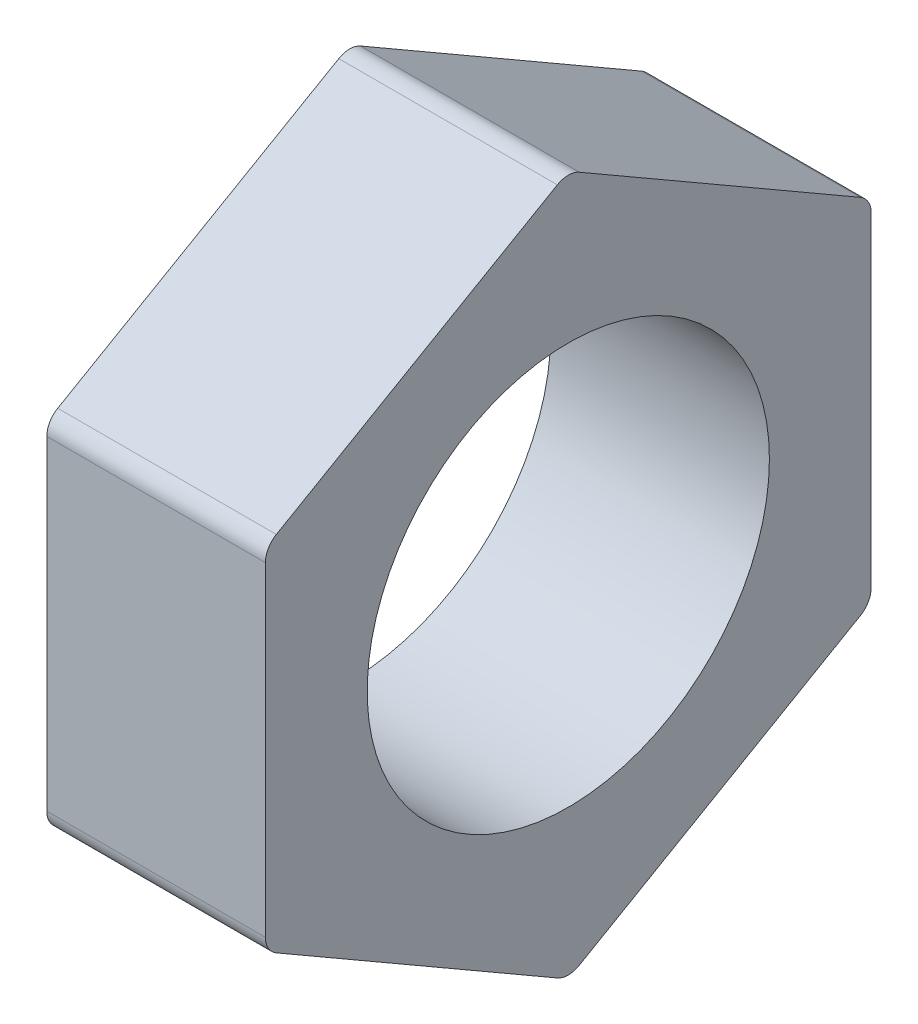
from build123d import *

# Parameters (mm, degrees)
SKETCH1_R           = 4.6
BOSS_EXTRUDE1_DEPTH = 2.5


with BuildPart() as part:
    # Sketch1 → Boss-Extrude1 (new, symmetric)
    with BuildSketch(Plane(origin=(0, 0, 0), x_dir=(0, 0, -1), z_dir=(1, 0, 0))):
        with BuildLine():
            Line((-6.67820323, 4.144337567), (-0.25, 7.855662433))
            ThreePointArc((-0.25, 7.855662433), (0, 7.922649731), (0.25, 7.855662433))
            Line((0.25, 7.855662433), (6.67820323, 4.144337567))
            ThreePointArc((6.67820323, 4.144337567), (6.861215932, 3.961324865), (6.92820323, 3.711324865))
            Line((6.92820323, 3.711324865), (6.92820323, -3.711324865))
            ThreePointArc((6.92820323, -3.711324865), (6.861215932, -3.961324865), (6.67820323, -4.144337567))
            Line((6.67820323, -4.144337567), (0.25, -7.855662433))
            ThreePointArc((0.25, -7.855662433), (0, -7.922649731), (-0.25, -7.855662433))
            Line((-0.25, -7.855662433), (-6.67820323, -4.144337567))
            ThreePointArc((-6.67820323, -4.144337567), (-6.861215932, -3.961324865), (-6.92820323, -3.711324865))
            Line((-6.92820323, -3.711324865), (-6.92820323, 3.711324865))
            ThreePointArc((-6.92820323, 3.711324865), (-6.861215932, 3.961324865), (-6.67820323, 4.144337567))
        make_face()
        Circle(SKETCH1_R, mode=Mode.SUBTRACT)
    extrude(amount=BOSS_EXTRUDE1_DEPTH, both=True)


solid = part.part
